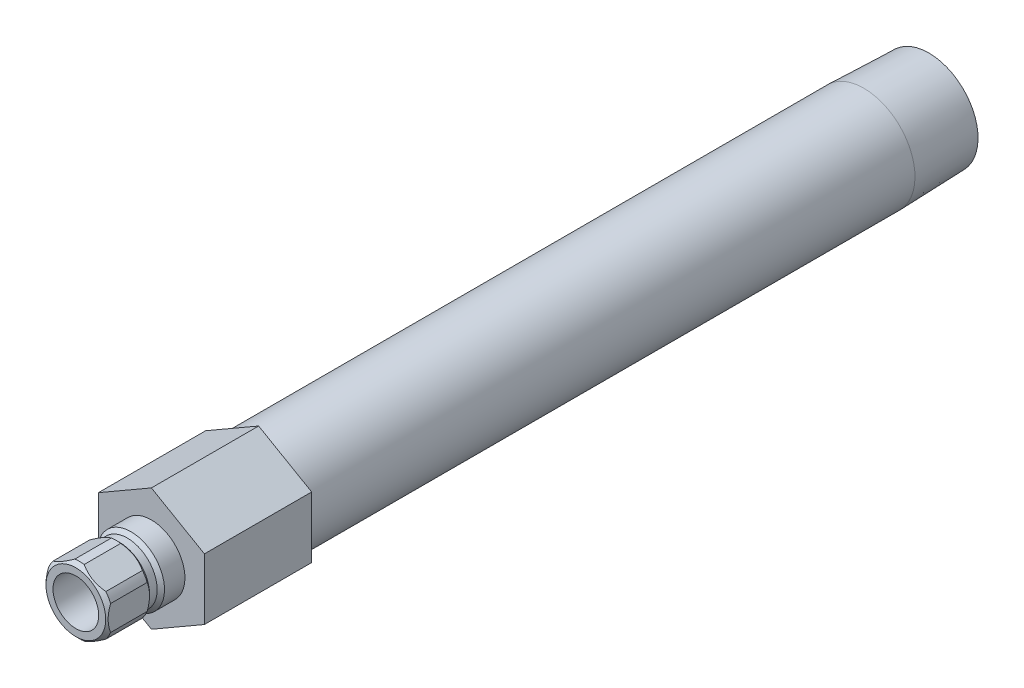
from build123d import *

# Parameters (mm, degrees)
SKETCH2_R           = 4.7625
BOSS_EXTRUDE1_DEPTH = 22.352
CUT_EXTRUDE1_START  = 6.604
SKETCH3_OUTSIDE_W   = 60.294
SKETCH3_OUTSIDE_H   = 63.712
CUT_EXTRUDE1_DEPTH  = 157.324527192


with BuildPart() as part:
    # Sketch1 → Revolve1 (revolve)
    with BuildSketch(Plane(origin=(0, 0, 0), x_dir=(0, 0, -1), z_dir=(1, 0, 0))):
        Polygon((-15.748, 4.7625), (-15.748, 6.223), (-14.986, 6.985), (-7.366, 6.985), (-6.604, 6.223), (-5.0165, 6.223), (-4.2545, 6.985), (0, 6.985), (0, 10.668), (148.4884, 10.668), (162.052, 10.244140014), (162.052, 7.8994), (22.352, 7.8994), (22.352, 4.7625), align=None)
    revolve(axis=Axis((0, 0, 13.122373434), (0, 0, 1)))

    # Sketch2 → Boss-Extrude1 (add)
    with BuildSketch(Plane.XY):
        Polygon((-11.049, 6.379143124), (-11.049, -6.379143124), (0, -12.758286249), (11.049, -6.379143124), (11.049, 6.379143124), (0, 12.758286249), align=None)
        with Locations(Location((0, 0, 0), (0, 0, 90))):
            Circle(SKETCH2_R, mode=Mode.SUBTRACT)
    extrude(amount=-BOSS_EXTRUDE1_DEPTH)

    # Sketch3 outside → Cut-Extrude1 (cut, through all)
    with BuildSketch(Plane.XY.offset(CUT_EXTRUDE1_START)):
        Rectangle(SKETCH3_OUTSIDE_W, SKETCH3_OUTSIDE_H)
        Polygon((6.477, -3.739497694), (6.477, 3.739497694), (0, 7.478995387), (-6.477, 3.739497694), (-6.477, -3.739497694), (0, -7.478995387), align=None, mode=Mode.SUBTRACT)
    extrude(amount=CUT_EXTRUDE1_DEPTH, mode=Mode.SUBTRACT)


solid = part.part
